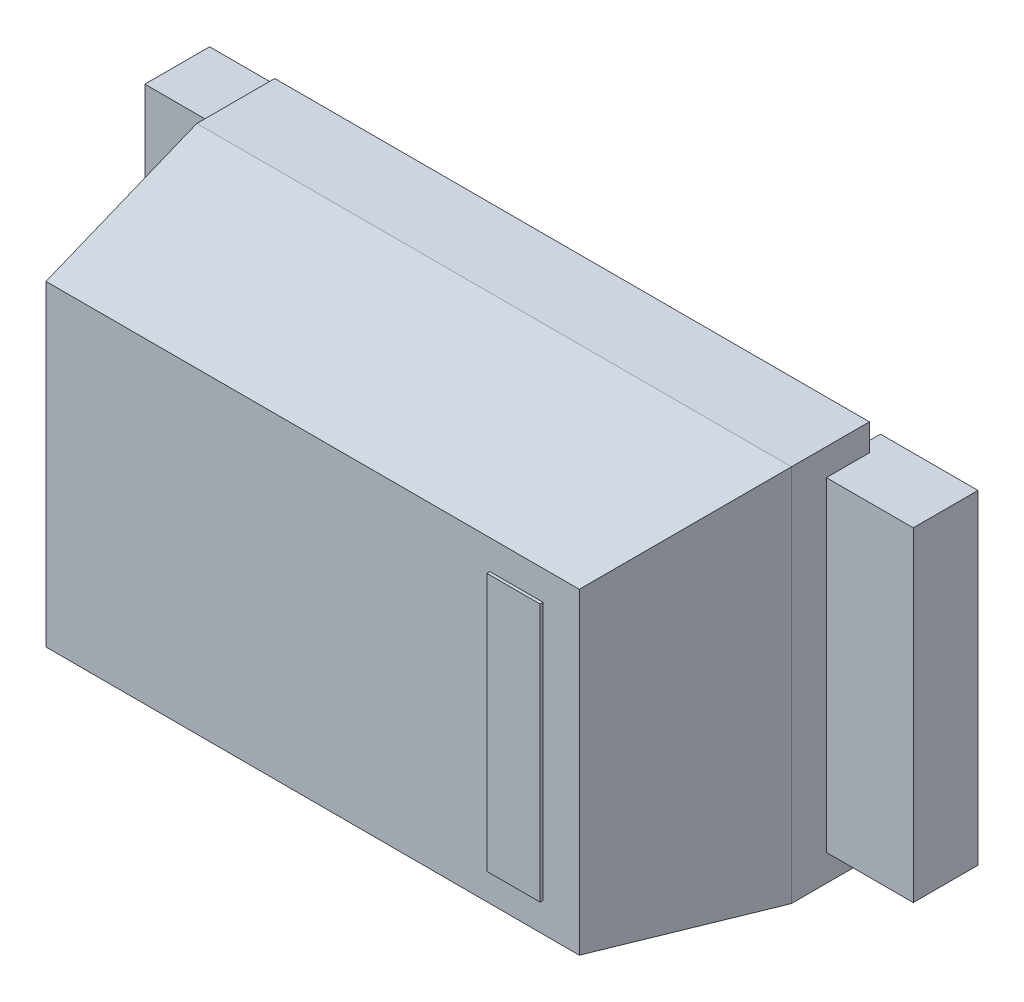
ISO-10303-21;
HEADER;
FILE_DESCRIPTION(('STEP AP214'),'2;1');
FILE_NAME('part.step','',(''),(''),'','','');
FILE_SCHEMA(('AUTOMOTIVE_DESIGN { 1 0 10303 214 1 1 1 1 }'));
ENDSEC;
DATA;
#1=APPLICATION_CONTEXT('core data for automotive mechanical design processes');
#2=APPLICATION_PROTOCOL_DEFINITION('international standard','automotive_design',2000,#1);
#3=PRODUCT_CONTEXT('',#1,'mechanical');
#4=PRODUCT('Part','Part','',(#3));
#5=PRODUCT_RELATED_PRODUCT_CATEGORY('part','',(#4));
#6=PRODUCT_DEFINITION_FORMATION('','',#4);
#7=PRODUCT_DEFINITION_CONTEXT('part definition',#1,'design');
#8=PRODUCT_DEFINITION('design','',#6,#7);
#9=PRODUCT_DEFINITION_SHAPE('','',#8);
#10=(LENGTH_UNIT() NAMED_UNIT(*) SI_UNIT(.MILLI.,.METRE.));
#11=(NAMED_UNIT(*) PLANE_ANGLE_UNIT() SI_UNIT($,.RADIAN.));
#12=(NAMED_UNIT(*) SI_UNIT($,.STERADIAN.) SOLID_ANGLE_UNIT());
#13=UNCERTAINTY_MEASURE_WITH_UNIT(LENGTH_MEASURE(1.E-05),#10,'distance_accuracy_value','');
#14=(GEOMETRIC_REPRESENTATION_CONTEXT(3) GLOBAL_UNCERTAINTY_ASSIGNED_CONTEXT((#13)) GLOBAL_UNIT_ASSIGNED_CONTEXT((#10,
#11,#12)) REPRESENTATION_CONTEXT('',''));
#15=CARTESIAN_POINT('',(0.,0.,0.));
#16=DIRECTION('',(0.,0.,1.));
#17=DIRECTION('',(1.,0.,0.));
#18=AXIS2_PLACEMENT_3D('',#15,#16,#17);
#19=CARTESIAN_POINT('',(0.416,-0.303,0.667));
#20=DIRECTION('',(0.,0.,1.));
#21=DIRECTION('',(1.,0.,0.));
#22=AXIS2_PLACEMENT_3D('',#19,#20,#21);
#23=PLANE('',#22);
#24=DIRECTION('',(1.,0.,0.));
#25=VECTOR('',#24,1.);
#26=CARTESIAN_POINT('',(0.416,-0.303,0.667));
#27=LINE('',#26,#25);
#28=CARTESIAN_POINT('',(0.416,-0.303,0.667));
#29=VERTEX_POINT('',#28);
#30=CARTESIAN_POINT('',(0.541,-0.303,0.667));
#31=VERTEX_POINT('',#30);
#32=EDGE_CURVE('P0_E88',#29,#31,#27,.T.);
#33=ORIENTED_EDGE('',*,*,#32,.T.);
#34=DIRECTION('',(0.,1.,0.));
#35=VECTOR('',#34,1.);
#36=CARTESIAN_POINT('',(0.541,-0.303,0.667));
#37=LINE('',#36,#35);
#38=CARTESIAN_POINT('',(0.541,0.303,0.667));
#39=VERTEX_POINT('',#38);
#40=EDGE_CURVE('P0_E61',#31,#39,#37,.T.);
#41=ORIENTED_EDGE('',*,*,#40,.T.);
#42=DIRECTION('',(-1.,0.,0.));
#43=VECTOR('',#42,1.);
#44=CARTESIAN_POINT('',(0.541,0.303,0.667));
#45=LINE('',#44,#43);
#46=CARTESIAN_POINT('',(0.416,0.303,0.667));
#47=VERTEX_POINT('',#46);
#48=EDGE_CURVE('P0_E80',#39,#47,#45,.T.);
#49=ORIENTED_EDGE('',*,*,#48,.T.);
#50=DIRECTION('',(0.,-1.,0.));
#51=VECTOR('',#50,1.);
#52=CARTESIAN_POINT('',(0.416,0.303,0.667));
#53=LINE('',#52,#51);
#54=EDGE_CURVE('P0_E10',#47,#29,#53,.T.);
#55=ORIENTED_EDGE('',*,*,#54,.T.);
#56=EDGE_LOOP('',(#33,#41,#49,#55));
#57=FACE_BOUND('',#56,.T.);
#58=ADVANCED_FACE('P0_F16',(#57),#23,.T.);
#59=CARTESIAN_POINT('',(0.416,0.303,0.66));
#60=DIRECTION('',(0.,0.,-1.));
#61=DIRECTION('',(0.,-1.,0.));
#62=AXIS2_PLACEMENT_3D('',#59,#60,#61);
#63=PLANE('',#62);
#64=DIRECTION('',(1.,0.,0.));
#65=VECTOR('',#64,1.);
#66=CARTESIAN_POINT('',(0.416,0.303,0.66));
#67=LINE('',#66,#65);
#68=CARTESIAN_POINT('',(0.416,0.303,0.66));
#69=VERTEX_POINT('',#68);
#70=CARTESIAN_POINT('',(0.541,0.303,0.66));
#71=VERTEX_POINT('',#70);
#72=EDGE_CURVE('P0_E91',#69,#71,#67,.T.);
#73=ORIENTED_EDGE('',*,*,#72,.T.);
#74=DIRECTION('',(0.,-1.,0.));
#75=VECTOR('',#74,1.);
#76=CARTESIAN_POINT('',(0.541,0.303,0.66));
#77=LINE('',#76,#75);
#78=CARTESIAN_POINT('',(0.541,-0.303,0.66));
#79=VERTEX_POINT('',#78);
#80=EDGE_CURVE('P0_E72',#71,#79,#77,.T.);
#81=ORIENTED_EDGE('',*,*,#80,.T.);
#82=DIRECTION('',(-1.,0.,0.));
#83=VECTOR('',#82,1.);
#84=CARTESIAN_POINT('',(0.541,-0.303,0.66));
#85=LINE('',#84,#83);
#86=CARTESIAN_POINT('',(0.416,-0.303,0.66));
#87=VERTEX_POINT('',#86);
#88=EDGE_CURVE('P0_E109',#79,#87,#85,.T.);
#89=ORIENTED_EDGE('',*,*,#88,.T.);
#90=DIRECTION('',(0.,1.,0.));
#91=VECTOR('',#90,1.);
#92=CARTESIAN_POINT('',(0.416,-0.303,0.66));
#93=LINE('',#92,#91);
#94=EDGE_CURVE('P0_E25',#87,#69,#93,.T.);
#95=ORIENTED_EDGE('',*,*,#94,.T.);
#96=EDGE_LOOP('',(#73,#81,#89,#95));
#97=FACE_BOUND('',#96,.T.);
#98=ADVANCED_FACE('P0_F119',(#97),#63,.T.);
#99=CARTESIAN_POINT('',(0.416,0.303,0.66));
#100=DIRECTION('',(-1.,0.,0.));
#101=DIRECTION('',(0.,0.,1.));
#102=AXIS2_PLACEMENT_3D('',#99,#100,#101);
#103=PLANE('',#102);
#104=ORIENTED_EDGE('',*,*,#94,.F.);
#105=DIRECTION('',(0.,0.,1.));
#106=VECTOR('',#105,1.);
#107=CARTESIAN_POINT('',(0.416,-0.303,0.66));
#108=LINE('',#107,#106);
#109=EDGE_CURVE('P0_E97',#87,#29,#108,.T.);
#110=ORIENTED_EDGE('',*,*,#109,.T.);
#111=ORIENTED_EDGE('',*,*,#54,.F.);
#112=DIRECTION('',(0.,0.,-1.));
#113=VECTOR('',#112,1.);
#114=CARTESIAN_POINT('',(0.416,0.303,0.667));
#115=LINE('',#114,#113);
#116=EDGE_CURVE('P0_E84',#47,#69,#115,.T.);
#117=ORIENTED_EDGE('',*,*,#116,.T.);
#118=EDGE_LOOP('',(#104,#110,#111,#117));
#119=FACE_BOUND('',#118,.T.);
#120=ADVANCED_FACE('P0_F120',(#119),#103,.T.);
#121=CARTESIAN_POINT('',(0.541,0.303,0.66));
#122=DIRECTION('',(0.,1.,0.));
#123=DIRECTION('',(1.,0.,0.));
#124=AXIS2_PLACEMENT_3D('',#121,#122,#123);
#125=PLANE('',#124);
#126=ORIENTED_EDGE('',*,*,#72,.F.);
#127=ORIENTED_EDGE('',*,*,#116,.F.);
#128=ORIENTED_EDGE('',*,*,#48,.F.);
#129=DIRECTION('',(0.,0.,-1.));
#130=VECTOR('',#129,1.);
#131=CARTESIAN_POINT('',(0.541,0.303,0.667));
#132=LINE('',#131,#130);
#133=EDGE_CURVE('P0_E83',#39,#71,#132,.T.);
#134=ORIENTED_EDGE('',*,*,#133,.T.);
#135=EDGE_LOOP('',(#126,#127,#128,#134));
#136=FACE_BOUND('',#135,.T.);
#137=ADVANCED_FACE('P0_F82',(#136),#125,.T.);
#138=CARTESIAN_POINT('',(0.541,-0.303,0.66));
#139=DIRECTION('',(1.,0.,0.));
#140=DIRECTION('',(0.,1.,0.));
#141=AXIS2_PLACEMENT_3D('',#138,#139,#140);
#142=PLANE('',#141);
#143=ORIENTED_EDGE('',*,*,#80,.F.);
#144=ORIENTED_EDGE('',*,*,#133,.F.);
#145=ORIENTED_EDGE('',*,*,#40,.F.);
#146=DIRECTION('',(0.,0.,-1.));
#147=VECTOR('',#146,1.);
#148=CARTESIAN_POINT('',(0.541,-0.303,0.667));
#149=LINE('',#148,#147);
#150=EDGE_CURVE('P0_E104',#31,#79,#149,.T.);
#151=ORIENTED_EDGE('',*,*,#150,.T.);
#152=EDGE_LOOP('',(#143,#144,#145,#151));
#153=FACE_BOUND('',#152,.T.);
#154=ADVANCED_FACE('P0_F93',(#153),#142,.T.);
#155=CARTESIAN_POINT('',(0.416,-0.303,0.66));
#156=DIRECTION('',(0.,-1.,0.));
#157=DIRECTION('',(0.,0.,-1.));
#158=AXIS2_PLACEMENT_3D('',#155,#156,#157);
#159=PLANE('',#158);
#160=ORIENTED_EDGE('',*,*,#88,.F.);
#161=ORIENTED_EDGE('',*,*,#150,.F.);
#162=ORIENTED_EDGE('',*,*,#32,.F.);
#163=ORIENTED_EDGE('',*,*,#109,.F.);
#164=EDGE_LOOP('',(#160,#161,#162,#163));
#165=FACE_BOUND('',#164,.T.);
#166=ADVANCED_FACE('P0_F118',(#165),#159,.T.);
#167=CLOSED_SHELL('',(#58,#98,#120,#137,#154,#166));
#168=MANIFOLD_SOLID_BREP('P0_B1',#167);
#169=CARTESIAN_POINT('',(-0.698,0.444,0.051));
#170=DIRECTION('',(-1.,0.,0.));
#171=DIRECTION('',(0.,0.,1.));
#172=AXIS2_PLACEMENT_3D('',#169,#170,#171);
#173=PLANE('',#172);
#174=DIRECTION('',(0.,-1.,0.));
#175=VECTOR('',#174,1.);
#176=CARTESIAN_POINT('',(-0.698,0.444,0.051));
#177=LINE('',#176,#175);
#178=CARTESIAN_POINT('',(-0.698,0.444,0.051));
#179=VERTEX_POINT('',#178);
#180=CARTESIAN_POINT('',(-0.698,-0.444,0.051));
#181=VERTEX_POINT('',#180);
#182=EDGE_CURVE('P1_E87',#179,#181,#177,.T.);
#183=ORIENTED_EDGE('',*,*,#182,.T.);
#184=DIRECTION('',(0.,0.,1.));
#185=VECTOR('',#184,1.);
#186=CARTESIAN_POINT('',(-0.698,-0.444,0.051));
#187=LINE('',#186,#185);
#188=CARTESIAN_POINT('',(-0.698,-0.444,0.234));
#189=VERTEX_POINT('',#188);
#190=EDGE_CURVE('P1_E131',#181,#189,#187,.T.);
#191=ORIENTED_EDGE('',*,*,#190,.T.);
#192=DIRECTION('',(0.,1.,0.));
#193=VECTOR('',#192,1.);
#194=CARTESIAN_POINT('',(-0.698,-0.444,0.234));
#195=LINE('',#194,#193);
#196=CARTESIAN_POINT('',(-0.698,0.444,0.234));
#197=VERTEX_POINT('',#196);
#198=EDGE_CURVE('P1_E90',#189,#197,#195,.T.);
#199=ORIENTED_EDGE('',*,*,#198,.T.);
#200=DIRECTION('',(0.,0.,-1.));
#201=VECTOR('',#200,1.);
#202=CARTESIAN_POINT('',(-0.698,0.444,0.234));
#203=LINE('',#202,#201);
#204=EDGE_CURVE('P1_E11',#197,#179,#203,.T.);
#205=ORIENTED_EDGE('',*,*,#204,.T.);
#206=EDGE_LOOP('',(#183,#191,#199,#205));
#207=FACE_BOUND('',#206,.T.);
#208=ADVANCED_FACE('P1_F17',(#207),#173,.T.);
#209=CARTESIAN_POINT('',(0.698,0.444,0.051));
#210=DIRECTION('',(0.,1.,0.));
#211=DIRECTION('',(1.,0.,0.));
#212=AXIS2_PLACEMENT_3D('',#209,#210,#211);
#213=PLANE('',#212);
#214=DIRECTION('',(-1.,0.,0.));
#215=VECTOR('',#214,1.);
#216=CARTESIAN_POINT('',(0.698,0.444,0.051));
#217=LINE('',#216,#215);
#218=CARTESIAN_POINT('',(0.698,0.444,0.051));
#219=VERTEX_POINT('',#218);
#220=EDGE_CURVE('P1_E96',#219,#179,#217,.T.);
#221=ORIENTED_EDGE('',*,*,#220,.T.);
#222=ORIENTED_EDGE('',*,*,#204,.F.);
#223=DIRECTION('',(1.,0.,0.));
#224=VECTOR('',#223,1.);
#225=CARTESIAN_POINT('',(-0.698,0.444,0.234));
#226=LINE('',#225,#224);
#227=CARTESIAN_POINT('',(0.698,0.444,0.234));
#228=VERTEX_POINT('',#227);
#229=EDGE_CURVE('P1_E123',#197,#228,#226,.T.);
#230=ORIENTED_EDGE('',*,*,#229,.T.);
#231=DIRECTION('',(0.,0.,-1.));
#232=VECTOR('',#231,1.);
#233=CARTESIAN_POINT('',(0.698,0.444,0.234));
#234=LINE('',#233,#232);
#235=EDGE_CURVE('P1_E31',#228,#219,#234,.T.);
#236=ORIENTED_EDGE('',*,*,#235,.T.);
#237=EDGE_LOOP('',(#221,#222,#230,#236));
#238=FACE_BOUND('',#237,.T.);
#239=ADVANCED_FACE('P1_F101',(#238),#213,.T.);
#240=CARTESIAN_POINT('',(0.698,-0.444,0.051));
#241=DIRECTION('',(1.,0.,0.));
#242=DIRECTION('',(0.,1.,0.));
#243=AXIS2_PLACEMENT_3D('',#240,#241,#242);
#244=PLANE('',#243);
#245=DIRECTION('',(0.,1.,0.));
#246=VECTOR('',#245,1.);
#247=CARTESIAN_POINT('',(0.698,-0.444,0.051));
#248=LINE('',#247,#246);
#249=CARTESIAN_POINT('',(0.698,-0.444,0.051));
#250=VERTEX_POINT('',#249);
#251=EDGE_CURVE('P1_E103',#250,#219,#248,.T.);
#252=ORIENTED_EDGE('',*,*,#251,.T.);
#253=ORIENTED_EDGE('',*,*,#235,.F.);
#254=DIRECTION('',(0.,-1.,0.));
#255=VECTOR('',#254,1.);
#256=CARTESIAN_POINT('',(0.698,0.444,0.234));
#257=LINE('',#256,#255);
#258=CARTESIAN_POINT('',(0.698,-0.444,0.234));
#259=VERTEX_POINT('',#258);
#260=EDGE_CURVE('P1_E134',#228,#259,#257,.T.);
#261=ORIENTED_EDGE('',*,*,#260,.T.);
#262=DIRECTION('',(0.,0.,-1.));
#263=VECTOR('',#262,1.);
#264=CARTESIAN_POINT('',(0.698,-0.444,0.234));
#265=LINE('',#264,#263);
#266=EDGE_CURVE('P1_E80',#259,#250,#265,.T.);
#267=ORIENTED_EDGE('',*,*,#266,.T.);
#268=EDGE_LOOP('',(#252,#253,#261,#267));
#269=FACE_BOUND('',#268,.T.);
#270=ADVANCED_FACE('P1_F378',(#269),#244,.T.);
#271=CARTESIAN_POINT('',(-0.698,-0.444,0.051));
#272=DIRECTION('',(0.,-1.,0.));
#273=DIRECTION('',(0.,0.,-1.));
#274=AXIS2_PLACEMENT_3D('',#271,#272,#273);
#275=PLANE('',#274);
#276=DIRECTION('',(1.,0.,0.));
#277=VECTOR('',#276,1.);
#278=CARTESIAN_POINT('',(-0.698,-0.444,0.051));
#279=LINE('',#278,#277);
#280=EDGE_CURVE('P1_E97',#181,#250,#279,.T.);
#281=ORIENTED_EDGE('',*,*,#280,.T.);
#282=ORIENTED_EDGE('',*,*,#266,.F.);
#283=DIRECTION('',(-1.,0.,0.));
#284=VECTOR('',#283,1.);
#285=CARTESIAN_POINT('',(0.698,-0.444,0.234));
#286=LINE('',#285,#284);
#287=EDGE_CURVE('P1_E99',#259,#189,#286,.T.);
#288=ORIENTED_EDGE('',*,*,#287,.T.);
#289=ORIENTED_EDGE('',*,*,#190,.F.);
#290=EDGE_LOOP('',(#281,#282,#288,#289));
#291=FACE_BOUND('',#290,.T.);
#292=ADVANCED_FACE('P1_F168',(#291),#275,.T.);
#293=CARTESIAN_POINT('',(-0.698,0.444,0.234));
#294=DIRECTION('',(-0.985627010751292,0.,0.168936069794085));
#295=DIRECTION('',(0.,1.,0.));
#296=AXIS2_PLACEMENT_3D('',#293,#294,#295);
#297=PLANE('',#296);
#298=ORIENTED_EDGE('',*,*,#198,.F.);
#299=CARTESIAN_POINT('',(-0.698,-0.444,0.234));
#300=DIRECTION('',(0.16659196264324,0.166008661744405,0.971950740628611));
#301=VECTOR('',#300,1.);
#302=LINE('',#299,#301);
#303=CARTESIAN_POINT('',(-0.625580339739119,-0.371580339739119,0.659856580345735));
#304=VERTEX_POINT('',#303);
#305=EDGE_CURVE('P1_E137',#189,#304,#302,.T.);
#306=ORIENTED_EDGE('',*,*,#305,.T.);
#307=CARTESIAN_POINT('',(-0.625012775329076,-0.372,0.6598307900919));
#308=DIRECTION('',(0.,1.,0.));
#309=VECTOR('',#308,1.);
#310=LINE('',#307,#309);
#311=CARTESIAN_POINT('',(-0.626,0.372,0.66));
#312=VERTEX_POINT('',#311);
#313=EDGE_CURVE('P1_E104',#304,#312,#310,.T.);
#314=ORIENTED_EDGE('',*,*,#313,.T.);
#315=CARTESIAN_POINT('',(-0.625012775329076,0.372,0.6598307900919));
#316=DIRECTION('',(-0.16659196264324,0.166008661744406,-0.971950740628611));
#317=VECTOR('',#316,1.);
#318=LINE('',#315,#317);
#319=EDGE_CURVE('P1_E120',#312,#197,#318,.T.);
#320=ORIENTED_EDGE('',*,*,#319,.T.);
#321=EDGE_LOOP('',(#298,#306,#314,#320));
#322=FACE_BOUND('',#321,.T.);
#323=ADVANCED_FACE('P1_F158',(#322),#297,.T.);
#324=CARTESIAN_POINT('',(0.698,0.444,0.234));
#325=DIRECTION('',(0.,0.985627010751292,0.168936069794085));
#326=DIRECTION('',(1.,0.,0.));
#327=AXIS2_PLACEMENT_3D('',#324,#325,#326);
#328=PLANE('',#327);
#329=ORIENTED_EDGE('',*,*,#229,.F.);
#330=ORIENTED_EDGE('',*,*,#319,.F.);
#331=CARTESIAN_POINT('',(-0.626,0.371012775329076,0.6598307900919));
#332=DIRECTION('',(1.,0.,0.));
#333=VECTOR('',#332,1.);
#334=LINE('',#331,#333);
#335=CARTESIAN_POINT('',(0.626,0.372,0.66));
#336=VERTEX_POINT('',#335);
#337=EDGE_CURVE('P1_E113',#312,#336,#334,.T.);
#338=ORIENTED_EDGE('',*,*,#337,.T.);
#339=CARTESIAN_POINT('',(0.626,0.371012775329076,0.6598307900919));
#340=DIRECTION('',(0.166008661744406,0.16659196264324,-0.971950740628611));
#341=VECTOR('',#340,1.);
#342=LINE('',#339,#341);
#343=EDGE_CURVE('P1_E126',#336,#228,#342,.T.);
#344=ORIENTED_EDGE('',*,*,#343,.T.);
#345=EDGE_LOOP('',(#329,#330,#338,#344));
#346=FACE_BOUND('',#345,.T.);
#347=ADVANCED_FACE('P1_F167',(#346),#328,.T.);
#348=CARTESIAN_POINT('',(0.698,-0.444,0.234));
#349=DIRECTION('',(0.985627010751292,0.,0.168936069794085));
#350=DIRECTION('',(0.,-1.,0.));
#351=AXIS2_PLACEMENT_3D('',#348,#349,#350);
#352=PLANE('',#351);
#353=ORIENTED_EDGE('',*,*,#260,.F.);
#354=ORIENTED_EDGE('',*,*,#343,.F.);
#355=CARTESIAN_POINT('',(0.625012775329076,0.372,0.6598307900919));
#356=DIRECTION('',(0.,-1.,0.));
#357=VECTOR('',#356,1.);
#358=LINE('',#355,#357);
#359=CARTESIAN_POINT('',(0.626,-0.372,0.66));
#360=VERTEX_POINT('',#359);
#361=EDGE_CURVE('P1_E288',#336,#360,#358,.T.);
#362=ORIENTED_EDGE('',*,*,#361,.T.);
#363=CARTESIAN_POINT('',(0.625012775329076,-0.372,0.6598307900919));
#364=DIRECTION('',(0.16659196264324,-0.166008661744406,-0.971950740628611));
#365=VECTOR('',#364,1.);
#366=LINE('',#363,#365);
#367=EDGE_CURVE('P1_E147',#360,#259,#366,.T.);
#368=ORIENTED_EDGE('',*,*,#367,.T.);
#369=EDGE_LOOP('',(#353,#354,#362,#368));
#370=FACE_BOUND('',#369,.T.);
#371=ADVANCED_FACE('P1_F169',(#370),#352,.T.);
#372=CARTESIAN_POINT('',(-0.698,-0.444,0.234));
#373=DIRECTION('',(0.,-0.985627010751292,0.168936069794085));
#374=DIRECTION('',(-1.,0.,0.));
#375=AXIS2_PLACEMENT_3D('',#372,#373,#374);
#376=PLANE('',#375);
#377=ORIENTED_EDGE('',*,*,#287,.F.);
#378=ORIENTED_EDGE('',*,*,#367,.F.);
#379=CARTESIAN_POINT('',(0.626,-0.371012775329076,0.6598307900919));
#380=DIRECTION('',(-1.,0.,0.));
#381=VECTOR('',#380,1.);
#382=LINE('',#379,#381);
#383=EDGE_CURVE('P1_E280',#360,#304,#382,.T.);
#384=ORIENTED_EDGE('',*,*,#383,.T.);
#385=ORIENTED_EDGE('',*,*,#305,.F.);
#386=EDGE_LOOP('',(#377,#378,#384,#385));
#387=FACE_BOUND('',#386,.T.);
#388=ADVANCED_FACE('P1_F19',(#387),#376,.T.);
#389=CARTESIAN_POINT('',(-0.698,0.444,0.051));
#390=DIRECTION('',(0.,0.,-1.));
#391=DIRECTION('',(0.,-1.,0.));
#392=AXIS2_PLACEMENT_3D('',#389,#390,#391);
#393=PLANE('',#392);
#394=ORIENTED_EDGE('',*,*,#220,.F.);
#395=ORIENTED_EDGE('',*,*,#251,.F.);
#396=ORIENTED_EDGE('',*,*,#280,.F.);
#397=ORIENTED_EDGE('',*,*,#182,.F.);
#398=EDGE_LOOP('',(#394,#395,#396,#397));
#399=FACE_BOUND('',#398,.T.);
#400=ADVANCED_FACE('P1_F94',(#399),#393,.T.);
#401=CARTESIAN_POINT('',(-0.626,-0.372,0.66));
#402=DIRECTION('',(0.,0.,1.));
#403=DIRECTION('',(1.,0.,0.));
#404=AXIS2_PLACEMENT_3D('',#401,#402,#403);
#405=PLANE('',#404);
#406=ORIENTED_EDGE('',*,*,#383,.F.);
#407=ORIENTED_EDGE('',*,*,#361,.F.);
#408=ORIENTED_EDGE('',*,*,#337,.F.);
#409=ORIENTED_EDGE('',*,*,#313,.F.);
#410=EDGE_LOOP('',(#406,#407,#408,#409));
#411=FACE_BOUND('',#410,.T.);
#412=ADVANCED_FACE('P1_F247',(#411),#405,.T.);
#413=CLOSED_SHELL('',(#208,#239,#270,#292,#323,#347,#371,#388,#400,#412));
#414=MANIFOLD_SOLID_BREP('P1_B1',#413);
#415=CARTESIAN_POINT('',(-0.902,0.381,0.));
#416=DIRECTION('',(0.,0.,-1.));
#417=DIRECTION('',(0.,-1.,0.));
#418=AXIS2_PLACEMENT_3D('',#415,#416,#417);
#419=PLANE('',#418);
#420=DIRECTION('',(1.,0.,0.));
#421=VECTOR('',#420,1.);
#422=CARTESIAN_POINT('',(-0.902,0.381,0.));
#423=LINE('',#422,#421);
#424=CARTESIAN_POINT('',(-0.902,0.381,0.));
#425=VERTEX_POINT('',#424);
#426=CARTESIAN_POINT('',(-0.673,0.381,0.));
#427=VERTEX_POINT('',#426);
#428=EDGE_CURVE('P2_E104',#425,#427,#423,.T.);
#429=ORIENTED_EDGE('',*,*,#428,.T.);
#430=DIRECTION('',(0.,-1.,0.));
#431=VECTOR('',#430,1.);
#432=CARTESIAN_POINT('',(-0.673,0.381,0.));
#433=LINE('',#432,#431);
#434=CARTESIAN_POINT('',(-0.673,-0.381,0.));
#435=VERTEX_POINT('',#434);
#436=EDGE_CURVE('P2_E11',#427,#435,#433,.T.);
#437=ORIENTED_EDGE('',*,*,#436,.T.);
#438=DIRECTION('',(-1.,0.,0.));
#439=VECTOR('',#438,1.);
#440=CARTESIAN_POINT('',(-0.673,-0.381,0.));
#441=LINE('',#440,#439);
#442=CARTESIAN_POINT('',(-0.902,-0.381,0.));
#443=VERTEX_POINT('',#442);
#444=EDGE_CURVE('P2_E122',#435,#443,#441,.T.);
#445=ORIENTED_EDGE('',*,*,#444,.T.);
#446=DIRECTION('',(0.,1.,0.));
#447=VECTOR('',#446,1.);
#448=CARTESIAN_POINT('',(-0.902,-0.381,0.));
#449=LINE('',#448,#447);
#450=EDGE_CURVE('P2_E28',#443,#425,#449,.T.);
#451=ORIENTED_EDGE('',*,*,#450,.T.);
#452=EDGE_LOOP('',(#429,#437,#445,#451));
#453=FACE_BOUND('',#452,.T.);
#454=ADVANCED_FACE('P2_F17',(#453),#419,.T.);
#455=CARTESIAN_POINT('',(-0.698,-0.381,0.051));
#456=DIRECTION('',(1.,0.,0.));
#457=DIRECTION('',(0.,1.,0.));
#458=AXIS2_PLACEMENT_3D('',#455,#456,#457);
#459=PLANE('',#458);
#460=DIRECTION('',(0.,1.,0.));
#461=VECTOR('',#460,1.);
#462=CARTESIAN_POINT('',(-0.698,-0.381,0.051));
#463=LINE('',#462,#461);
#464=CARTESIAN_POINT('',(-0.698,-0.381,0.051));
#465=VERTEX_POINT('',#464);
#466=CARTESIAN_POINT('',(-0.698,0.381,0.051));
#467=VERTEX_POINT('',#466);
#468=EDGE_CURVE('P2_E124',#465,#467,#463,.T.);
#469=ORIENTED_EDGE('',*,*,#468,.T.);
#470=DIRECTION('',(0.,0.,1.));
#471=VECTOR('',#470,1.);
#472=CARTESIAN_POINT('',(-0.698,0.381,0.051));
#473=LINE('',#472,#471);
#474=CARTESIAN_POINT('',(-0.698,0.381,0.152));
#475=VERTEX_POINT('',#474);
#476=EDGE_CURVE('P2_E143',#467,#475,#473,.T.);
#477=ORIENTED_EDGE('',*,*,#476,.T.);
#478=DIRECTION('',(0.,-1.,0.));
#479=VECTOR('',#478,1.);
#480=CARTESIAN_POINT('',(-0.698,0.381,0.152));
#481=LINE('',#480,#479);
#482=CARTESIAN_POINT('',(-0.698,-0.381,0.152));
#483=VERTEX_POINT('',#482);
#484=EDGE_CURVE('P2_E95',#475,#483,#481,.T.);
#485=ORIENTED_EDGE('',*,*,#484,.T.);
#486=DIRECTION('',(0.,0.,-1.));
#487=VECTOR('',#486,1.);
#488=CARTESIAN_POINT('',(-0.698,-0.381,0.152));
#489=LINE('',#488,#487);
#490=EDGE_CURVE('P2_E108',#483,#465,#489,.T.);
#491=ORIENTED_EDGE('',*,*,#490,.T.);
#492=EDGE_LOOP('',(#469,#477,#485,#491));
#493=FACE_BOUND('',#492,.T.);
#494=ADVANCED_FACE('P2_F19',(#493),#459,.T.);
#495=CARTESIAN_POINT('',(-0.673,-0.381,0.));
#496=DIRECTION('',(1.,0.,0.));
#497=DIRECTION('',(0.,1.,0.));
#498=AXIS2_PLACEMENT_3D('',#495,#496,#497);
#499=PLANE('',#498);
#500=ORIENTED_EDGE('',*,*,#436,.F.);
#501=DIRECTION('',(0.,0.,1.));
#502=VECTOR('',#501,1.);
#503=CARTESIAN_POINT('',(-0.673,0.381,0.));
#504=LINE('',#503,#502);
#505=CARTESIAN_POINT('',(-0.673,0.381,0.051));
#506=VERTEX_POINT('',#505);
#507=EDGE_CURVE('P2_E119',#427,#506,#504,.T.);
#508=ORIENTED_EDGE('',*,*,#507,.T.);
#509=DIRECTION('',(0.,-1.,0.));
#510=VECTOR('',#509,1.);
#511=CARTESIAN_POINT('',(-0.673,0.381,0.051));
#512=LINE('',#511,#510);
#513=CARTESIAN_POINT('',(-0.673,-0.381,0.051));
#514=VERTEX_POINT('',#513);
#515=EDGE_CURVE('P2_E42',#506,#514,#512,.T.);
#516=ORIENTED_EDGE('',*,*,#515,.T.);
#517=DIRECTION('',(0.,0.,-1.));
#518=VECTOR('',#517,1.);
#519=CARTESIAN_POINT('',(-0.673,-0.381,0.051));
#520=LINE('',#519,#518);
#521=EDGE_CURVE('P2_E120',#514,#435,#520,.T.);
#522=ORIENTED_EDGE('',*,*,#521,.T.);
#523=EDGE_LOOP('',(#500,#508,#516,#522));
#524=FACE_BOUND('',#523,.T.);
#525=ADVANCED_FACE('P2_F156',(#524),#499,.T.);
#526=CARTESIAN_POINT('',(-0.902,0.381,0.));
#527=DIRECTION('',(-1.,0.,0.));
#528=DIRECTION('',(0.,0.,1.));
#529=AXIS2_PLACEMENT_3D('',#526,#527,#528);
#530=PLANE('',#529);
#531=ORIENTED_EDGE('',*,*,#450,.F.);
#532=DIRECTION('',(0.,0.,1.));
#533=VECTOR('',#532,1.);
#534=CARTESIAN_POINT('',(-0.902,-0.381,0.));
#535=LINE('',#534,#533);
#536=CARTESIAN_POINT('',(-0.902,-0.381,0.152));
#537=VERTEX_POINT('',#536);
#538=EDGE_CURVE('P2_E21',#443,#537,#535,.T.);
#539=ORIENTED_EDGE('',*,*,#538,.T.);
#540=DIRECTION('',(0.,1.,0.));
#541=VECTOR('',#540,1.);
#542=CARTESIAN_POINT('',(-0.902,-0.381,0.152));
#543=LINE('',#542,#541);
#544=CARTESIAN_POINT('',(-0.902,0.381,0.152));
#545=VERTEX_POINT('',#544);
#546=EDGE_CURVE('P2_E82',#537,#545,#543,.T.);
#547=ORIENTED_EDGE('',*,*,#546,.T.);
#548=DIRECTION('',(0.,0.,-1.));
#549=VECTOR('',#548,1.);
#550=CARTESIAN_POINT('',(-0.902,0.381,0.152));
#551=LINE('',#550,#549);
#552=EDGE_CURVE('P2_E131',#545,#425,#551,.T.);
#553=ORIENTED_EDGE('',*,*,#552,.T.);
#554=EDGE_LOOP('',(#531,#539,#547,#553));
#555=FACE_BOUND('',#554,.T.);
#556=ADVANCED_FACE('P2_F99',(#555),#530,.T.);
#557=CARTESIAN_POINT('',(-0.698,-0.381,0.051));
#558=DIRECTION('',(0.,0.,1.));
#559=DIRECTION('',(1.,0.,0.));
#560=AXIS2_PLACEMENT_3D('',#557,#558,#559);
#561=PLANE('',#560);
#562=DIRECTION('',(1.,0.,0.));
#563=VECTOR('',#562,1.);
#564=CARTESIAN_POINT('',(-0.698,-0.381,0.051));
#565=LINE('',#564,#563);
#566=EDGE_CURVE('P2_E115',#465,#514,#565,.T.);
#567=ORIENTED_EDGE('',*,*,#566,.T.);
#568=ORIENTED_EDGE('',*,*,#515,.F.);
#569=DIRECTION('',(-1.,0.,0.));
#570=VECTOR('',#569,1.);
#571=CARTESIAN_POINT('',(-0.673,0.381,0.051));
#572=LINE('',#571,#570);
#573=EDGE_CURVE('P2_E147',#506,#467,#572,.T.);
#574=ORIENTED_EDGE('',*,*,#573,.T.);
#575=ORIENTED_EDGE('',*,*,#468,.F.);
#576=EDGE_LOOP('',(#567,#568,#574,#575));
#577=FACE_BOUND('',#576,.T.);
#578=ADVANCED_FACE('P2_F206',(#577),#561,.T.);
#579=CARTESIAN_POINT('',(-0.902,-0.381,0.152));
#580=DIRECTION('',(0.,0.,1.));
#581=DIRECTION('',(1.,0.,0.));
#582=AXIS2_PLACEMENT_3D('',#579,#580,#581);
#583=PLANE('',#582);
#584=DIRECTION('',(1.,0.,0.));
#585=VECTOR('',#584,1.);
#586=CARTESIAN_POINT('',(-0.902,-0.381,0.152));
#587=LINE('',#586,#585);
#588=EDGE_CURVE('P2_E87',#537,#483,#587,.T.);
#589=ORIENTED_EDGE('',*,*,#588,.T.);
#590=ORIENTED_EDGE('',*,*,#484,.F.);
#591=DIRECTION('',(-1.,0.,0.));
#592=VECTOR('',#591,1.);
#593=CARTESIAN_POINT('',(-0.698,0.381,0.152));
#594=LINE('',#593,#592);
#595=EDGE_CURVE('P2_E90',#475,#545,#594,.T.);
#596=ORIENTED_EDGE('',*,*,#595,.T.);
#597=ORIENTED_EDGE('',*,*,#546,.F.);
#598=EDGE_LOOP('',(#589,#590,#596,#597));
#599=FACE_BOUND('',#598,.T.);
#600=ADVANCED_FACE('P2_F84',(#599),#583,.T.);
#601=CARTESIAN_POINT('',(-0.673,0.381,0.));
#602=DIRECTION('',(0.,1.,0.));
#603=DIRECTION('',(1.,0.,0.));
#604=AXIS2_PLACEMENT_3D('',#601,#602,#603);
#605=PLANE('',#604);
#606=ORIENTED_EDGE('',*,*,#428,.F.);
#607=ORIENTED_EDGE('',*,*,#552,.F.);
#608=ORIENTED_EDGE('',*,*,#595,.F.);
#609=ORIENTED_EDGE('',*,*,#476,.F.);
#610=ORIENTED_EDGE('',*,*,#573,.F.);
#611=ORIENTED_EDGE('',*,*,#507,.F.);
#612=EDGE_LOOP('',(#606,#607,#608,#609,#610,#611));
#613=FACE_BOUND('',#612,.T.);
#614=ADVANCED_FACE('P2_F159',(#613),#605,.T.);
#615=CARTESIAN_POINT('',(-0.902,-0.381,0.));
#616=DIRECTION('',(0.,-1.,0.));
#617=DIRECTION('',(0.,0.,-1.));
#618=AXIS2_PLACEMENT_3D('',#615,#616,#617);
#619=PLANE('',#618);
#620=ORIENTED_EDGE('',*,*,#444,.F.);
#621=ORIENTED_EDGE('',*,*,#521,.F.);
#622=ORIENTED_EDGE('',*,*,#566,.F.);
#623=ORIENTED_EDGE('',*,*,#490,.F.);
#624=ORIENTED_EDGE('',*,*,#588,.F.);
#625=ORIENTED_EDGE('',*,*,#538,.F.);
#626=EDGE_LOOP('',(#620,#621,#622,#623,#624,#625));
#627=FACE_BOUND('',#626,.T.);
#628=ADVANCED_FACE('P2_F105',(#627),#619,.T.);
#629=CLOSED_SHELL('',(#454,#494,#525,#556,#578,#600,#614,#628));
#630=MANIFOLD_SOLID_BREP('P2_B1',#629);
#631=CARTESIAN_POINT('',(0.902,-0.381,0.));
#632=DIRECTION('',(0.,0.,-1.));
#633=DIRECTION('',(0.,-1.,0.));
#634=AXIS2_PLACEMENT_3D('',#631,#632,#633);
#635=PLANE('',#634);
#636=DIRECTION('',(-1.,0.,0.));
#637=VECTOR('',#636,1.);
#638=CARTESIAN_POINT('',(0.902,-0.381,0.));
#639=LINE('',#638,#637);
#640=CARTESIAN_POINT('',(0.902,-0.381,0.));
#641=VERTEX_POINT('',#640);
#642=CARTESIAN_POINT('',(0.673,-0.381,0.));
#643=VERTEX_POINT('',#642);
#644=EDGE_CURVE('P3_E135',#641,#643,#639,.T.);
#645=ORIENTED_EDGE('',*,*,#644,.T.);
#646=DIRECTION('',(0.,1.,0.));
#647=VECTOR('',#646,1.);
#648=CARTESIAN_POINT('',(0.673,-0.381,0.));
#649=LINE('',#648,#647);
#650=CARTESIAN_POINT('',(0.673,0.381,0.));
#651=VERTEX_POINT('',#650);
#652=EDGE_CURVE('P3_E10',#643,#651,#649,.T.);
#653=ORIENTED_EDGE('',*,*,#652,.T.);
#654=DIRECTION('',(1.,0.,0.));
#655=VECTOR('',#654,1.);
#656=CARTESIAN_POINT('',(0.673,0.381,0.));
#657=LINE('',#656,#655);
#658=CARTESIAN_POINT('',(0.902,0.381,0.));
#659=VERTEX_POINT('',#658);
#660=EDGE_CURVE('P3_E20',#651,#659,#657,.T.);
#661=ORIENTED_EDGE('',*,*,#660,.T.);
#662=DIRECTION('',(0.,-1.,0.));
#663=VECTOR('',#662,1.);
#664=CARTESIAN_POINT('',(0.902,0.381,0.));
#665=LINE('',#664,#663);
#666=EDGE_CURVE('P3_E27',#659,#641,#665,.T.);
#667=ORIENTED_EDGE('',*,*,#666,.T.);
#668=EDGE_LOOP('',(#645,#653,#661,#667));
#669=FACE_BOUND('',#668,.T.);
#670=ADVANCED_FACE('P3_F16',(#669),#635,.T.);
#671=CARTESIAN_POINT('',(0.698,0.381,0.051));
#672=DIRECTION('',(-1.,0.,0.));
#673=DIRECTION('',(0.,0.,1.));
#674=AXIS2_PLACEMENT_3D('',#671,#672,#673);
#675=PLANE('',#674);
#676=DIRECTION('',(0.,-1.,0.));
#677=VECTOR('',#676,1.);
#678=CARTESIAN_POINT('',(0.698,0.381,0.051));
#679=LINE('',#678,#677);
#680=CARTESIAN_POINT('',(0.698,0.381,0.051));
#681=VERTEX_POINT('',#680);
#682=CARTESIAN_POINT('',(0.698,-0.381,0.051));
#683=VERTEX_POINT('',#682);
#684=EDGE_CURVE('P3_E127',#681,#683,#679,.T.);
#685=ORIENTED_EDGE('',*,*,#684,.T.);
#686=DIRECTION('',(0.,0.,1.));
#687=VECTOR('',#686,1.);
#688=CARTESIAN_POINT('',(0.698,-0.381,0.051));
#689=LINE('',#688,#687);
#690=CARTESIAN_POINT('',(0.698,-0.381,0.152));
#691=VERTEX_POINT('',#690);
#692=EDGE_CURVE('P3_E101',#683,#691,#689,.T.);
#693=ORIENTED_EDGE('',*,*,#692,.T.);
#694=DIRECTION('',(0.,1.,0.));
#695=VECTOR('',#694,1.);
#696=CARTESIAN_POINT('',(0.698,-0.381,0.152));
#697=LINE('',#696,#695);
#698=CARTESIAN_POINT('',(0.698,0.381,0.152));
#699=VERTEX_POINT('',#698);
#700=EDGE_CURVE('P3_E95',#691,#699,#697,.T.);
#701=ORIENTED_EDGE('',*,*,#700,.T.);
#702=DIRECTION('',(0.,0.,-1.));
#703=VECTOR('',#702,1.);
#704=CARTESIAN_POINT('',(0.698,0.381,0.152));
#705=LINE('',#704,#703);
#706=EDGE_CURVE('P3_E98',#699,#681,#705,.T.);
#707=ORIENTED_EDGE('',*,*,#706,.T.);
#708=EDGE_LOOP('',(#685,#693,#701,#707));
#709=FACE_BOUND('',#708,.T.);
#710=ADVANCED_FACE('P3_F96',(#709),#675,.T.);
#711=CARTESIAN_POINT('',(0.673,0.381,0.));
#712=DIRECTION('',(-1.,0.,0.));
#713=DIRECTION('',(0.,0.,1.));
#714=AXIS2_PLACEMENT_3D('',#711,#712,#713);
#715=PLANE('',#714);
#716=ORIENTED_EDGE('',*,*,#652,.F.);
#717=DIRECTION('',(0.,0.,1.));
#718=VECTOR('',#717,1.);
#719=CARTESIAN_POINT('',(0.673,-0.381,0.));
#720=LINE('',#719,#718);
#721=CARTESIAN_POINT('',(0.673,-0.381,0.051));
#722=VERTEX_POINT('',#721);
#723=EDGE_CURVE('P3_E104',#643,#722,#720,.T.);
#724=ORIENTED_EDGE('',*,*,#723,.T.);
#725=DIRECTION('',(0.,1.,0.));
#726=VECTOR('',#725,1.);
#727=CARTESIAN_POINT('',(0.673,-0.381,0.051));
#728=LINE('',#727,#726);
#729=CARTESIAN_POINT('',(0.673,0.381,0.051));
#730=VERTEX_POINT('',#729);
#731=EDGE_CURVE('P3_E41',#722,#730,#728,.T.);
#732=ORIENTED_EDGE('',*,*,#731,.T.);
#733=DIRECTION('',(0.,0.,-1.));
#734=VECTOR('',#733,1.);
#735=CARTESIAN_POINT('',(0.673,0.381,0.051));
#736=LINE('',#735,#734);
#737=EDGE_CURVE('P3_E123',#730,#651,#736,.T.);
#738=ORIENTED_EDGE('',*,*,#737,.T.);
#739=EDGE_LOOP('',(#716,#724,#732,#738));
#740=FACE_BOUND('',#739,.T.);
#741=ADVANCED_FACE('P3_F164',(#740),#715,.T.);
#742=CARTESIAN_POINT('',(0.902,-0.381,0.));
#743=DIRECTION('',(1.,0.,0.));
#744=DIRECTION('',(0.,1.,0.));
#745=AXIS2_PLACEMENT_3D('',#742,#743,#744);
#746=PLANE('',#745);
#747=ORIENTED_EDGE('',*,*,#666,.F.);
#748=DIRECTION('',(0.,0.,1.));
#749=VECTOR('',#748,1.);
#750=CARTESIAN_POINT('',(0.902,0.381,0.));
#751=LINE('',#750,#749);
#752=CARTESIAN_POINT('',(0.902,0.381,0.152));
#753=VERTEX_POINT('',#752);
#754=EDGE_CURVE('P3_E112',#659,#753,#751,.T.);
#755=ORIENTED_EDGE('',*,*,#754,.T.);
#756=DIRECTION('',(0.,-1.,0.));
#757=VECTOR('',#756,1.);
#758=CARTESIAN_POINT('',(0.902,0.381,0.152));
#759=LINE('',#758,#757);
#760=CARTESIAN_POINT('',(0.902,-0.381,0.152));
#761=VERTEX_POINT('',#760);
#762=EDGE_CURVE('P3_E86',#753,#761,#759,.T.);
#763=ORIENTED_EDGE('',*,*,#762,.T.);
#764=DIRECTION('',(0.,0.,-1.));
#765=VECTOR('',#764,1.);
#766=CARTESIAN_POINT('',(0.902,-0.381,0.152));
#767=LINE('',#766,#765);
#768=EDGE_CURVE('P3_E130',#761,#641,#767,.T.);
#769=ORIENTED_EDGE('',*,*,#768,.T.);
#770=EDGE_LOOP('',(#747,#755,#763,#769));
#771=FACE_BOUND('',#770,.T.);
#772=ADVANCED_FACE('P3_F158',(#771),#746,.T.);
#773=CARTESIAN_POINT('',(0.698,0.381,0.051));
#774=DIRECTION('',(0.,0.,1.));
#775=DIRECTION('',(1.,0.,0.));
#776=AXIS2_PLACEMENT_3D('',#773,#774,#775);
#777=PLANE('',#776);
#778=DIRECTION('',(-1.,0.,0.));
#779=VECTOR('',#778,1.);
#780=CARTESIAN_POINT('',(0.698,0.381,0.051));
#781=LINE('',#780,#779);
#782=EDGE_CURVE('P3_E117',#681,#730,#781,.T.);
#783=ORIENTED_EDGE('',*,*,#782,.T.);
#784=ORIENTED_EDGE('',*,*,#731,.F.);
#785=DIRECTION('',(1.,0.,0.));
#786=VECTOR('',#785,1.);
#787=CARTESIAN_POINT('',(0.673,-0.381,0.051));
#788=LINE('',#787,#786);
#789=EDGE_CURVE('P3_E140',#722,#683,#788,.T.);
#790=ORIENTED_EDGE('',*,*,#789,.T.);
#791=ORIENTED_EDGE('',*,*,#684,.F.);
#792=EDGE_LOOP('',(#783,#784,#790,#791));
#793=FACE_BOUND('',#792,.T.);
#794=ADVANCED_FACE('P3_F18',(#793),#777,.T.);
#795=CARTESIAN_POINT('',(0.902,0.381,0.152));
#796=DIRECTION('',(0.,0.,1.));
#797=DIRECTION('',(1.,0.,0.));
#798=AXIS2_PLACEMENT_3D('',#795,#796,#797);
#799=PLANE('',#798);
#800=DIRECTION('',(-1.,0.,0.));
#801=VECTOR('',#800,1.);
#802=CARTESIAN_POINT('',(0.902,0.381,0.152));
#803=LINE('',#802,#801);
#804=EDGE_CURVE('P3_E107',#753,#699,#803,.T.);
#805=ORIENTED_EDGE('',*,*,#804,.T.);
#806=ORIENTED_EDGE('',*,*,#700,.F.);
#807=DIRECTION('',(1.,0.,0.));
#808=VECTOR('',#807,1.);
#809=CARTESIAN_POINT('',(0.698,-0.381,0.152));
#810=LINE('',#809,#808);
#811=EDGE_CURVE('P3_E128',#691,#761,#810,.T.);
#812=ORIENTED_EDGE('',*,*,#811,.T.);
#813=ORIENTED_EDGE('',*,*,#762,.F.);
#814=EDGE_LOOP('',(#805,#806,#812,#813));
#815=FACE_BOUND('',#814,.T.);
#816=ADVANCED_FACE('P3_F108',(#815),#799,.T.);
#817=CARTESIAN_POINT('',(0.673,-0.381,0.));
#818=DIRECTION('',(0.,-1.,0.));
#819=DIRECTION('',(0.,0.,-1.));
#820=AXIS2_PLACEMENT_3D('',#817,#818,#819);
#821=PLANE('',#820);
#822=ORIENTED_EDGE('',*,*,#644,.F.);
#823=ORIENTED_EDGE('',*,*,#768,.F.);
#824=ORIENTED_EDGE('',*,*,#811,.F.);
#825=ORIENTED_EDGE('',*,*,#692,.F.);
#826=ORIENTED_EDGE('',*,*,#789,.F.);
#827=ORIENTED_EDGE('',*,*,#723,.F.);
#828=EDGE_LOOP('',(#822,#823,#824,#825,#826,#827));
#829=FACE_BOUND('',#828,.T.);
#830=ADVANCED_FACE('P3_F161',(#829),#821,.T.);
#831=CARTESIAN_POINT('',(0.902,0.381,0.));
#832=DIRECTION('',(0.,1.,0.));
#833=DIRECTION('',(1.,0.,0.));
#834=AXIS2_PLACEMENT_3D('',#831,#832,#833);
#835=PLANE('',#834);
#836=ORIENTED_EDGE('',*,*,#660,.F.);
#837=ORIENTED_EDGE('',*,*,#737,.F.);
#838=ORIENTED_EDGE('',*,*,#782,.F.);
#839=ORIENTED_EDGE('',*,*,#706,.F.);
#840=ORIENTED_EDGE('',*,*,#804,.F.);
#841=ORIENTED_EDGE('',*,*,#754,.F.);
#842=EDGE_LOOP('',(#836,#837,#838,#839,#840,#841));
#843=FACE_BOUND('',#842,.T.);
#844=ADVANCED_FACE('P3_F115',(#843),#835,.T.);
#845=CLOSED_SHELL('',(#670,#710,#741,#772,#794,#816,#830,#844));
#846=MANIFOLD_SOLID_BREP('P3_B1',#845);
#847=ADVANCED_BREP_SHAPE_REPRESENTATION('',(#18,#168,#414,#630,#846),#14);
#848=SHAPE_DEFINITION_REPRESENTATION(#9,#847);
ENDSEC;
END-ISO-10303-21;
